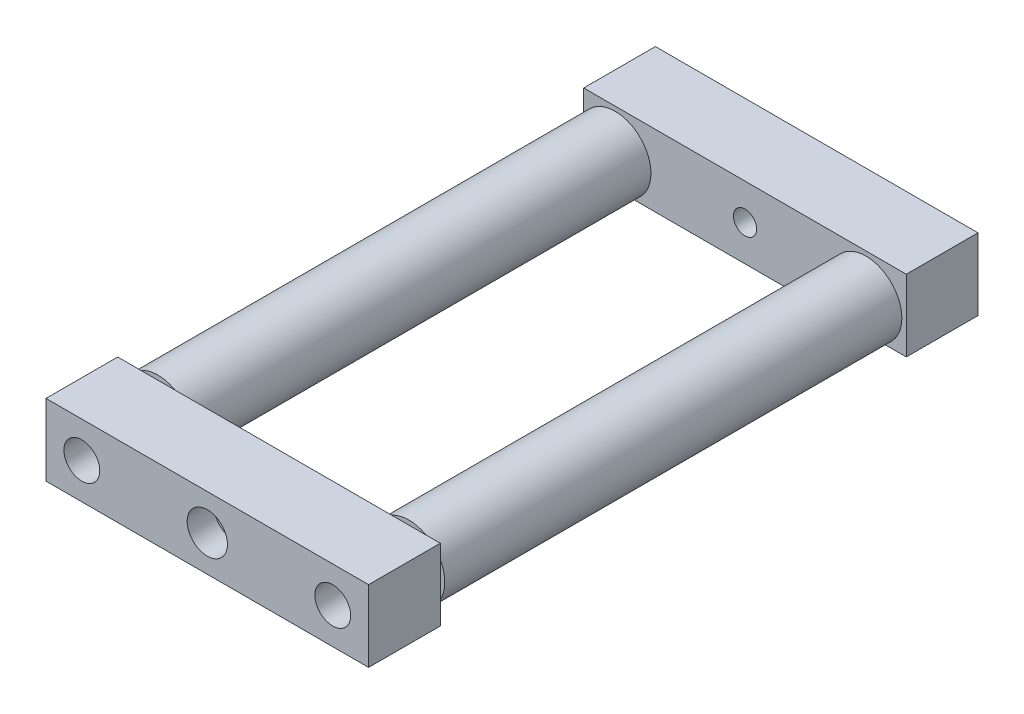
from build123d import *

# Parameters (mm, degrees)
BOSS_EXTRUDE1_START   = 41.275
SKETCH2_W             = 57.15
SKETCH2_H             = 12.7
SKETCH2_R             = 3.175
BOSS_EXTRUDE1_DEPTH   = 12.7
BOSS_EXTRUDE2_START   = -41.275
SKETCH3_W             = 57.15
SKETCH3_H             = 12.7
SKETCH3_R             = 3.175
BOSS_EXTRUDE2_DEPTH   = 12.7
SKETCH4_R             = 6.35
SKETCH4_R_2           = 3.175
BOSS_EXTRUDE3_DEPTH   = 40.4876
BOSS_EXTRUDE3_2_DEPTH = 40.4876
SKETCH5_R             = 2.0574
CUT_EXTRUDE1_DEPTH    = 50.8
CUT_EXTRUDE2_START    = 49.2252
SKETCH6_R             = 3.5687
CUT_EXTRUDE2_DEPTH    = 25.4
CUT_EXTRUDE3_START    = -74.6252
SKETCH7_R             = 3.5687
CUT_EXTRUDE3_DEPTH    = 25.4


with BuildPart() as part:
    # Sketch2 → Boss-Extrude1 (new body)
    with BuildSketch(Plane.XY.offset(BOSS_EXTRUDE1_START)):
        Rectangle(SKETCH2_W, SKETCH2_H)
        with Locations((-22.225, 0)):
            Circle(SKETCH2_R, mode=Mode.SUBTRACT)
        with Locations((22.225, 0)):
            Circle(SKETCH2_R, mode=Mode.SUBTRACT)
    extrude(amount=BOSS_EXTRUDE1_DEPTH)


with BuildPart() as body_2:
    # Sketch3 → Boss-Extrude2 (new body)
    with BuildSketch(Plane.XY.offset(BOSS_EXTRUDE2_START)):
        Rectangle(SKETCH3_W, SKETCH3_H)
        with Locations((-22.225, 0)):
            Circle(SKETCH3_R, mode=Mode.SUBTRACT)
        with Locations((22.225, 0)):
            Circle(SKETCH3_R, mode=Mode.SUBTRACT)
    extrude(amount=-BOSS_EXTRUDE2_DEPTH)


with BuildPart() as body_3:
    # Sketch4 → Boss-Extrude3 (new, symmetric)
    with BuildSketch(Plane.XY):
        with Locations((-22.225, 0)):
            Circle(SKETCH4_R)
        with Locations((-22.225, 0)):
            Circle(SKETCH4_R_2, mode=Mode.SUBTRACT)
    extrude(amount=BOSS_EXTRUDE3_DEPTH, both=True)


with BuildPart() as body_4:
    # Sketch4 → Boss-Extrude3 2 (new, symmetric)
    with BuildSketch(Plane.XY):
        with Locations((22.225, 0)):
            Circle(SKETCH4_R)
        with Locations((22.225, 0)):
            Circle(SKETCH4_R_2, mode=Mode.SUBTRACT)
    extrude(amount=BOSS_EXTRUDE3_2_DEPTH, both=True)


with BuildPart() as cut_extrude1_tool:
    # Sketch5 → Cut-Extrude1 (new, symmetric)
    with BuildSketch(Plane.XY):
        Circle(SKETCH5_R)
    extrude(amount=CUT_EXTRUDE1_DEPTH, both=True)


with BuildPart() as part_1:
    add(part.part)

    # Cut-Extrude1: cut by cut_extrude1_tool
    add(cut_extrude1_tool.part, mode=Mode.SUBTRACT)

    # Sketch6 → Cut-Extrude2 (cut)
    with BuildSketch(Plane.XY.offset(CUT_EXTRUDE2_START)):
        Circle(SKETCH6_R)
    extrude(amount=CUT_EXTRUDE2_DEPTH, mode=Mode.SUBTRACT)


with BuildPart() as body_2_1:
    add(body_2.part)

    # Cut-Extrude1: cut by cut_extrude1_tool
    add(cut_extrude1_tool.part, mode=Mode.SUBTRACT)

    # Sketch7 → Cut-Extrude3 (cut)
    with BuildSketch(Plane.XY.offset(CUT_EXTRUDE3_START)):
        Circle(SKETCH7_R)
    extrude(amount=CUT_EXTRUDE3_DEPTH, mode=Mode.SUBTRACT)


solid = Compound([body_3.part, body_4.part, part_1.part, body_2_1.part])
